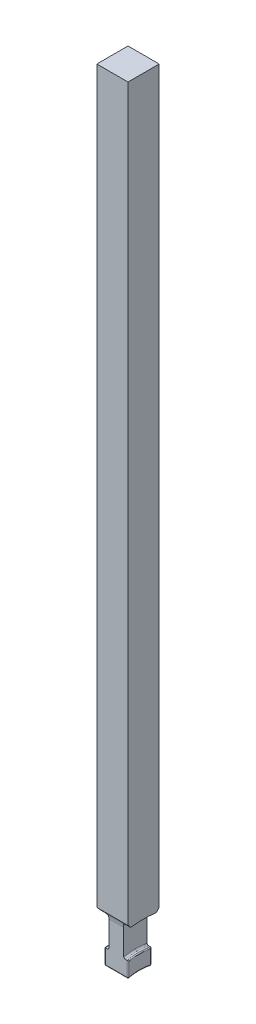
from build123d import *

# Parameters (mm, degrees)
SKETCH1_W               = 8
SKETCH1_H               = 212
BOSS_EXTRUDE1_DEPTH     = 4
CUT_EXTRUDE4_DEPTH      = 213.075458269
CUT_EXTRUDE4_DEPTH_BACK = 213.075458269
SKETCH8_R               = 12
SKETCH2_W               = 2.095
SKETCH2_H               = 8
CUT_EXTRUDE2_DEPTH      = 213.075458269
CUT_EXTRUDE2_DEPTH_BACK = 213.075458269
CUT_EXTRUDE3_DEPTH      = 213.075458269
CUT_EXTRUDE3_DEPTH_BACK = 213.075458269
SKETCH7_W               = 1
SKETCH7_H               = 16
FILLET1_R               = 0.762
FILLET2_R               = 0.381
FILLET3_R               = 0.254


with BuildPart() as part:
    # Sketch1 → Boss-Extrude1 (new, symmetric)
    with BuildSketch(Plane(origin=(0, 0, 0), x_dir=(0, 0, -1), z_dir=(1, 0, 0))):
        with Locations((0, 106)):
            Rectangle(SKETCH1_W, SKETCH1_H)
    extrude(amount=BOSS_EXTRUDE1_DEPTH, both=True)

    # Sketch8 → Cut-Extrude4 (cut, two sides: drawn at the far end of the back side and taken through both)
    with BuildSketch(Plane(origin=(0, 0, 0), x_dir=(0, 0, -1), z_dir=(1, 0, 0)).offset(-CUT_EXTRUDE4_DEPTH_BACK)):
        Circle(SKETCH8_R)
    extrude(amount=CUT_EXTRUDE4_DEPTH + CUT_EXTRUDE4_DEPTH_BACK, mode=Mode.SUBTRACT)

    # Sketch2 → Cut-Revolve1 (revolve, cut)
    with BuildSketch(Plane.XY):
        with Locations((2.9525, 20)):
            Rectangle(SKETCH2_W, SKETCH2_H)
        with Locations((-2.9525, 20)):
            Rectangle(SKETCH2_W, SKETCH2_H)
    revolve(axis=Axis((-8.84822894, 0, 0), (1, 0, 0)), mode=Mode.SUBTRACT)

    # Sketch6 → Cut-Extrude2 (cut, two sides: drawn at the far end of the back side and taken through both)
    with BuildSketch(Plane(origin=(0, 0, 0), x_dir=(0, 0, -1), z_dir=(1, 0, 0)).offset(-CUT_EXTRUDE2_DEPTH_BACK)):
        with BuildLine():
            Line((3, 0), (22.05, 0))
            Line((22.05, 0), (22.05, 25))
            Line((22.05, 25), (5.3876, 25))
            ThreePointArc((5.3876, 25), (3.699311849, 24.300688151), (3, 22.6124))
            Line((3, 22.6124), (3, 0))
        make_face()
        with BuildLine():
            Line((-3, 0), (-22.05, 0))
            Line((-22.05, 0), (-22.05, 25))
            Line((-22.05, 25), (-5.3876, 25))
            ThreePointArc((-5.3876, 25), (-3.699311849, 24.300688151), (-3, 22.6124))
            Line((-3, 22.6124), (-3, 0))
        make_face()
    extrude(amount=CUT_EXTRUDE2_DEPTH + CUT_EXTRUDE2_DEPTH_BACK, mode=Mode.SUBTRACT)

    # Sketch7 → Cut-Extrude3 (cut, two sides: drawn at the far end of the back side and taken through both)
    with BuildSketch(Plane.XY.offset(-CUT_EXTRUDE3_DEPTH_BACK)):
        with Locations((-3.5, 8)):
            Rectangle(SKETCH7_W, SKETCH7_H)
        with Locations((3.5, 8)):
            Rectangle(SKETCH7_W, SKETCH7_H)
    extrude(amount=CUT_EXTRUDE3_DEPTH + CUT_EXTRUDE3_DEPTH_BACK, mode=Mode.SUBTRACT)

    # Fillet1
    fillet1_edges = [part.edges().sort_by_distance(p)[0] for p in [
        (1.905, 24, 0),
        (-1.905, 24, 0),
    ]]
    fillet(fillet1_edges, radius=FILLET1_R)

    # Fillet2
    fillet2_edges = [part.edges().sort_by_distance(p)[0] for p in [
        (1.905, 16, 0),
        (-1.905, 16, 0),
    ]]
    fillet(fillet2_edges, radius=FILLET2_R)

    # Fillet3
    fillet3_edges = [part.edges().sort_by_distance(p)[0] for p in [
        (0, 11.618950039, -3),
        (3, 13.667591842, -3),
        (-3, 13.667591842, -3),
        (0, 11.618950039, 3),
        (-3, 16, 0),
        (-3, 13.667591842, 3),
        (-3, 12, 0),
        (3, 16, 0),
        (3, 12, 0),
        (3, 13.667591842, 3),
    ]]
    fillet(fillet3_edges, radius=FILLET3_R)


solid = part.part
